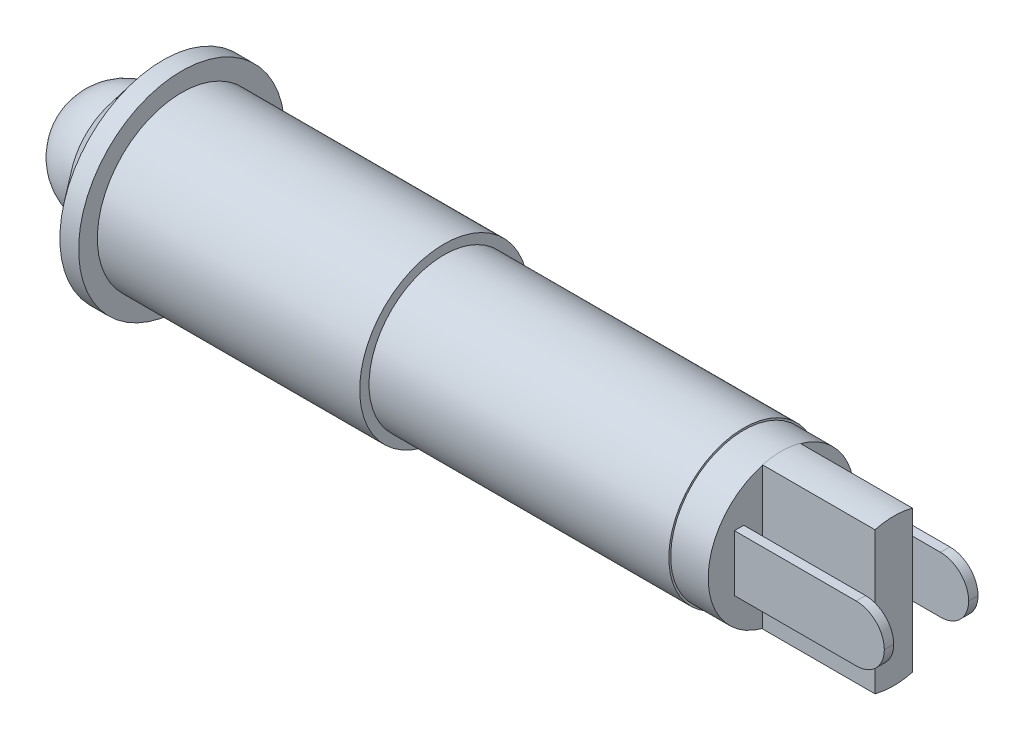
ISO-10303-21;
HEADER;
FILE_DESCRIPTION(('STEP AP214'),'2;1');
FILE_NAME('part.step','',(''),(''),'','','');
FILE_SCHEMA(('AUTOMOTIVE_DESIGN { 1 0 10303 214 1 1 1 1 }'));
ENDSEC;
DATA;
#1=APPLICATION_CONTEXT('core data for automotive mechanical design processes');
#2=APPLICATION_PROTOCOL_DEFINITION('international standard','automotive_design',2000,#1);
#3=PRODUCT_CONTEXT('',#1,'mechanical');
#4=PRODUCT('Part','Part','',(#3));
#5=PRODUCT_RELATED_PRODUCT_CATEGORY('part','',(#4));
#6=PRODUCT_DEFINITION_FORMATION('','',#4);
#7=PRODUCT_DEFINITION_CONTEXT('part definition',#1,'design');
#8=PRODUCT_DEFINITION('design','',#6,#7);
#9=PRODUCT_DEFINITION_SHAPE('','',#8);
#10=(LENGTH_UNIT() NAMED_UNIT(*) SI_UNIT(.MILLI.,.METRE.));
#11=(NAMED_UNIT(*) PLANE_ANGLE_UNIT() SI_UNIT($,.RADIAN.));
#12=(NAMED_UNIT(*) SI_UNIT($,.STERADIAN.) SOLID_ANGLE_UNIT());
#13=UNCERTAINTY_MEASURE_WITH_UNIT(LENGTH_MEASURE(1.E-05),#10,'distance_accuracy_value','');
#14=(GEOMETRIC_REPRESENTATION_CONTEXT(3) GLOBAL_UNCERTAINTY_ASSIGNED_CONTEXT((#13)) GLOBAL_UNIT_ASSIGNED_CONTEXT((#10,
#11,#12)) REPRESENTATION_CONTEXT('',''));
#15=CARTESIAN_POINT('',(0.,0.,0.));
#16=DIRECTION('',(0.,0.,1.));
#17=DIRECTION('',(1.,0.,0.));
#18=AXIS2_PLACEMENT_3D('',#15,#16,#17);
#19=CARTESIAN_POINT('',(35.,0.,0.));
#20=DIRECTION('',(1.,0.,0.));
#21=DIRECTION('',(0.,0.,-1.));
#22=AXIS2_PLACEMENT_3D('',#19,#20,#21);
#23=PLANE('',#22);
#24=DIRECTION('',(0.,1.,0.));
#25=VECTOR('',#24,1.);
#26=CARTESIAN_POINT('',(35.,3.79273138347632,-1.));
#27=LINE('',#26,#25);
#28=CARTESIAN_POINT('',(35.,-3.76961536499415,-1.));
#29=VERTEX_POINT('',#28);
#30=CARTESIAN_POINT('',(35.,3.76961536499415,-1.));
#31=VERTEX_POINT('',#30);
#32=EDGE_CURVE('E223',#29,#31,#27,.T.);
#33=ORIENTED_EDGE('',*,*,#32,.F.);
#34=CARTESIAN_POINT('',(35.,0.,0.));
#35=DIRECTION('',(1.,0.,0.));
#36=DIRECTION('',(0.,0.,-1.));
#37=AXIS2_PLACEMENT_3D('',#34,#35,#36);
#38=CIRCLE('',#37,3.9);
#39=EDGE_CURVE('E241',#29,#31,#38,.T.);
#40=ORIENTED_EDGE('',*,*,#39,.T.);
#41=EDGE_LOOP('',(#33,#40));
#42=FACE_BOUND('',#41,.T.);
#43=DIRECTION('',(0.,0.,-1.));
#44=VECTOR('',#43,1.);
#45=CARTESIAN_POINT('',(35.,-1.5,-2.));
#46=LINE('',#45,#44);
#47=CARTESIAN_POINT('',(35.,-1.5,-2.));
#48=VERTEX_POINT('',#47);
#49=CARTESIAN_POINT('',(35.,-1.5,-2.5));
#50=VERTEX_POINT('',#49);
#51=EDGE_CURVE('E151',#48,#50,#46,.T.);
#52=ORIENTED_EDGE('',*,*,#51,.F.);
#53=DIRECTION('',(0.,-1.,0.));
#54=VECTOR('',#53,1.);
#55=CARTESIAN_POINT('',(35.,1.5,-2.));
#56=LINE('',#55,#54);
#57=CARTESIAN_POINT('',(35.,1.5,-2.));
#58=VERTEX_POINT('',#57);
#59=EDGE_CURVE('E160',#58,#48,#56,.T.);
#60=ORIENTED_EDGE('',*,*,#59,.F.);
#61=DIRECTION('',(0.,0.,1.));
#62=VECTOR('',#61,1.);
#63=CARTESIAN_POINT('',(35.,1.5,-2.));
#64=LINE('',#63,#62);
#65=CARTESIAN_POINT('',(35.,1.5,-2.5));
#66=VERTEX_POINT('',#65);
#67=EDGE_CURVE('E172',#66,#58,#64,.T.);
#68=ORIENTED_EDGE('',*,*,#67,.F.);
#69=DIRECTION('',(0.,1.,0.));
#70=VECTOR('',#69,1.);
#71=CARTESIAN_POINT('',(35.,1.5,-2.5));
#72=LINE('',#71,#70);
#73=EDGE_CURVE('E170',#50,#66,#72,.T.);
#74=ORIENTED_EDGE('',*,*,#73,.F.);
#75=EDGE_LOOP('',(#52,#60,#68,#74));
#76=FACE_BOUND('',#75,.T.);
#77=ADVANCED_FACE('F34',(#42,#76),#23,.T.);
#78=DIRECTION('',(0.,-1.,0.));
#79=VECTOR('',#78,1.);
#80=CARTESIAN_POINT('',(35.,3.79273138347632,1.));
#81=LINE('',#80,#79);
#82=CARTESIAN_POINT('',(35.,3.76961536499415,1.));
#83=VERTEX_POINT('',#82);
#84=CARTESIAN_POINT('',(35.,-3.76961536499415,1.));
#85=VERTEX_POINT('',#84);
#86=EDGE_CURVE('E218',#83,#85,#81,.T.);
#87=ORIENTED_EDGE('',*,*,#86,.F.);
#88=EDGE_CURVE('E240',#83,#85,#38,.T.);
#89=ORIENTED_EDGE('',*,*,#88,.T.);
#90=EDGE_LOOP('',(#87,#89));
#91=FACE_BOUND('',#90,.T.);
#92=DIRECTION('',(0.,0.,-1.));
#93=VECTOR('',#92,1.);
#94=CARTESIAN_POINT('',(35.,-1.5,2.5));
#95=LINE('',#94,#93);
#96=CARTESIAN_POINT('',(35.,-1.5,2.5));
#97=VERTEX_POINT('',#96);
#98=CARTESIAN_POINT('',(35.,-1.5,2.));
#99=VERTEX_POINT('',#98);
#100=EDGE_CURVE('E182',#97,#99,#95,.T.);
#101=ORIENTED_EDGE('',*,*,#100,.F.);
#102=DIRECTION('',(0.,-1.,0.));
#103=VECTOR('',#102,1.);
#104=CARTESIAN_POINT('',(35.,1.5,2.5));
#105=LINE('',#104,#103);
#106=CARTESIAN_POINT('',(35.,1.5,2.5));
#107=VERTEX_POINT('',#106);
#108=EDGE_CURVE('E156',#107,#97,#105,.T.);
#109=ORIENTED_EDGE('',*,*,#108,.F.);
#110=DIRECTION('',(0.,0.,1.));
#111=VECTOR('',#110,1.);
#112=CARTESIAN_POINT('',(35.,1.5,2.5));
#113=LINE('',#112,#111);
#114=CARTESIAN_POINT('',(35.,1.5,2.));
#115=VERTEX_POINT('',#114);
#116=EDGE_CURVE('E188',#115,#107,#113,.T.);
#117=ORIENTED_EDGE('',*,*,#116,.F.);
#118=DIRECTION('',(0.,1.,0.));
#119=VECTOR('',#118,1.);
#120=CARTESIAN_POINT('',(35.,1.5,2.));
#121=LINE('',#120,#119);
#122=EDGE_CURVE('E185',#99,#115,#121,.T.);
#123=ORIENTED_EDGE('',*,*,#122,.F.);
#124=EDGE_LOOP('',(#101,#109,#117,#123));
#125=FACE_BOUND('',#124,.T.);
#126=ADVANCED_FACE('F307',(#91,#125),#23,.T.);
#127=CARTESIAN_POINT('',(33.,4.,0.));
#128=DIRECTION('',(1.,0.,0.));
#129=DIRECTION('',(0.,0.,-1.));
#130=AXIS2_PLACEMENT_3D('',#127,#128,#129);
#131=PLANE('',#130);
#132=CARTESIAN_POINT('',(33.,0.,0.));
#133=DIRECTION('',(1.,0.,0.));
#134=DIRECTION('',(0.,0.,-1.));
#135=AXIS2_PLACEMENT_3D('',#132,#133,#134);
#136=CIRCLE('',#135,4.);
#137=CARTESIAN_POINT('',(33.,0.,-4.));
#138=VERTEX_POINT('',#137);
#139=EDGE_CURVE('E246',#138,#138,#136,.T.);
#140=ORIENTED_EDGE('',*,*,#139,.T.);
#141=EDGE_LOOP('',(#140));
#142=FACE_BOUND('',#141,.T.);
#143=CARTESIAN_POINT('',(33.,0.,0.));
#144=DIRECTION('',(1.,0.,0.));
#145=DIRECTION('',(0.,0.,-1.));
#146=AXIS2_PLACEMENT_3D('',#143,#144,#145);
#147=CIRCLE('',#146,3.9);
#148=CARTESIAN_POINT('',(33.,0.,-3.9));
#149=VERTEX_POINT('',#148);
#150=EDGE_CURVE('E235',#149,#149,#147,.T.);
#151=ORIENTED_EDGE('',*,*,#150,.F.);
#152=EDGE_LOOP('',(#151));
#153=FACE_BOUND('',#152,.T.);
#154=ADVANCED_FACE('F326',(#142,#153),#131,.T.);
#155=CARTESIAN_POINT('',(2.,0.,0.));
#156=DIRECTION('',(1.,0.,0.));
#157=DIRECTION('',(0.,0.,-1.));
#158=AXIS2_PLACEMENT_3D('',#155,#156,#157);
#159=CONICAL_SURFACE('',#158,5.5,0.896055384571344);
#160=CARTESIAN_POINT('',(0.,0.,0.));
#161=DIRECTION('',(-1.,0.,0.));
#162=DIRECTION('',(0.,0.,1.));
#163=AXIS2_PLACEMENT_3D('',#160,#161,#162);
#164=CIRCLE('',#163,3.);
#165=CARTESIAN_POINT('',(0.,0.,3.));
#166=VERTEX_POINT('',#165);
#167=EDGE_CURVE('E239',#166,#166,#164,.T.);
#168=ORIENTED_EDGE('',*,*,#167,.F.);
#169=EDGE_LOOP('',(#168));
#170=FACE_BOUND('',#169,.T.);
#171=CARTESIAN_POINT('',(2.,0.,0.));
#172=DIRECTION('',(1.,0.,0.));
#173=DIRECTION('',(0.,0.,-1.));
#174=AXIS2_PLACEMENT_3D('',#171,#172,#173);
#175=CIRCLE('',#174,5.5);
#176=CARTESIAN_POINT('',(2.,0.,-5.5));
#177=VERTEX_POINT('',#176);
#178=EDGE_CURVE('E261',#177,#177,#175,.T.);
#179=ORIENTED_EDGE('',*,*,#178,.F.);
#180=EDGE_LOOP('',(#179));
#181=FACE_BOUND('',#180,.T.);
#182=ADVANCED_FACE('F344',(#170,#181),#159,.T.);
#183=CARTESIAN_POINT('',(33.,0.,0.));
#184=DIRECTION('',(1.,0.,0.));
#185=DIRECTION('',(0.,0.,-1.));
#186=AXIS2_PLACEMENT_3D('',#183,#184,#185);
#187=CYLINDRICAL_SURFACE('',#186,5.5);
#188=ORIENTED_EDGE('',*,*,#178,.T.);
#189=EDGE_LOOP('',(#188));
#190=FACE_BOUND('',#189,.T.);
#191=CARTESIAN_POINT('',(3.,0.,0.));
#192=DIRECTION('',(1.,0.,0.));
#193=DIRECTION('',(0.,0.,-1.));
#194=AXIS2_PLACEMENT_3D('',#191,#192,#193);
#195=CIRCLE('',#194,5.5);
#196=CARTESIAN_POINT('',(3.,0.,-5.5));
#197=VERTEX_POINT('',#196);
#198=EDGE_CURVE('E258',#197,#197,#195,.T.);
#199=ORIENTED_EDGE('',*,*,#198,.F.);
#200=EDGE_LOOP('',(#199));
#201=FACE_BOUND('',#200,.T.);
#202=ADVANCED_FACE('F360',(#190,#201),#187,.T.);
#203=CARTESIAN_POINT('',(3.,5.5,0.));
#204=DIRECTION('',(1.,0.,0.));
#205=DIRECTION('',(0.,0.,-1.));
#206=AXIS2_PLACEMENT_3D('',#203,#204,#205);
#207=PLANE('',#206);
#208=ORIENTED_EDGE('',*,*,#198,.T.);
#209=EDGE_LOOP('',(#208));
#210=FACE_BOUND('',#209,.T.);
#211=CARTESIAN_POINT('',(3.,0.,0.));
#212=DIRECTION('',(1.,0.,0.));
#213=DIRECTION('',(0.,0.,-1.));
#214=AXIS2_PLACEMENT_3D('',#211,#212,#213);
#215=CIRCLE('',#214,4.5);
#216=CARTESIAN_POINT('',(3.,0.,-4.5));
#217=VERTEX_POINT('',#216);
#218=EDGE_CURVE('E255',#217,#217,#215,.T.);
#219=ORIENTED_EDGE('',*,*,#218,.F.);
#220=EDGE_LOOP('',(#219));
#221=FACE_BOUND('',#220,.T.);
#222=ADVANCED_FACE('F356',(#210,#221),#207,.T.);
#223=CARTESIAN_POINT('',(33.,0.,0.));
#224=DIRECTION('',(1.,0.,0.));
#225=DIRECTION('',(0.,0.,-1.));
#226=AXIS2_PLACEMENT_3D('',#223,#224,#225);
#227=CYLINDRICAL_SURFACE('',#226,4.5);
#228=ORIENTED_EDGE('',*,*,#218,.T.);
#229=EDGE_LOOP('',(#228));
#230=FACE_BOUND('',#229,.T.);
#231=CARTESIAN_POINT('',(17.,0.,0.));
#232=DIRECTION('',(1.,0.,0.));
#233=DIRECTION('',(0.,0.,-1.));
#234=AXIS2_PLACEMENT_3D('',#231,#232,#233);
#235=CIRCLE('',#234,4.5);
#236=CARTESIAN_POINT('',(17.,0.,-4.5));
#237=VERTEX_POINT('',#236);
#238=EDGE_CURVE('E252',#237,#237,#235,.T.);
#239=ORIENTED_EDGE('',*,*,#238,.F.);
#240=EDGE_LOOP('',(#239));
#241=FACE_BOUND('',#240,.T.);
#242=ADVANCED_FACE('F352',(#230,#241),#227,.T.);
#243=CARTESIAN_POINT('',(17.,4.5,0.));
#244=DIRECTION('',(1.,0.,0.));
#245=DIRECTION('',(0.,0.,-1.));
#246=AXIS2_PLACEMENT_3D('',#243,#244,#245);
#247=PLANE('',#246);
#248=ORIENTED_EDGE('',*,*,#238,.T.);
#249=EDGE_LOOP('',(#248));
#250=FACE_BOUND('',#249,.T.);
#251=CARTESIAN_POINT('',(17.,0.,0.));
#252=DIRECTION('',(1.,0.,0.));
#253=DIRECTION('',(0.,0.,-1.));
#254=AXIS2_PLACEMENT_3D('',#251,#252,#253);
#255=CIRCLE('',#254,4.);
#256=CARTESIAN_POINT('',(17.,0.,-4.));
#257=VERTEX_POINT('',#256);
#258=EDGE_CURVE('E249',#257,#257,#255,.T.);
#259=ORIENTED_EDGE('',*,*,#258,.F.);
#260=EDGE_LOOP('',(#259));
#261=FACE_BOUND('',#260,.T.);
#262=ADVANCED_FACE('F348',(#250,#261),#247,.T.);
#263=CARTESIAN_POINT('',(33.,0.,0.));
#264=DIRECTION('',(1.,0.,0.));
#265=DIRECTION('',(0.,0.,-1.));
#266=AXIS2_PLACEMENT_3D('',#263,#264,#265);
#267=CYLINDRICAL_SURFACE('',#266,4.);
#268=ORIENTED_EDGE('',*,*,#258,.T.);
#269=EDGE_LOOP('',(#268));
#270=FACE_BOUND('',#269,.T.);
#271=ORIENTED_EDGE('',*,*,#139,.F.);
#272=EDGE_LOOP('',(#271));
#273=FACE_BOUND('',#272,.T.);
#274=ADVANCED_FACE('F340',(#270,#273),#267,.T.);
#275=CARTESIAN_POINT('',(0.,0.,0.));
#276=DIRECTION('',(0.,1.,0.));
#277=DIRECTION('',(1.,0.,0.));
#278=AXIS2_PLACEMENT_3D('',#275,#276,#277);
#279=SPHERICAL_SURFACE('',#278,3.);
#280=CARTESIAN_POINT('',(0.,0.,0.));
#281=DIRECTION('',(-1.,0.,0.));
#282=DIRECTION('',(0.,0.,1.));
#283=AXIS2_PLACEMENT_3D('',#280,#281,#282);
#284=SPHERICAL_SURFACE('',#283,3.);
#285=ORIENTED_EDGE('',*,*,#167,.T.);
#286=EDGE_LOOP('',(#285));
#287=FACE_BOUND('',#286,.T.);
#288=ADVANCED_FACE('F336',(#287),#284,.T.);
#289=CARTESIAN_POINT('',(35.,0.,0.));
#290=DIRECTION('',(-1.,0.,0.));
#291=DIRECTION('',(0.,0.,1.));
#292=AXIS2_PLACEMENT_3D('',#289,#290,#291);
#293=CYLINDRICAL_SURFACE('',#292,3.9);
#294=EDGE_CURVE('E236',#31,#83,#38,.T.);
#295=ORIENTED_EDGE('',*,*,#294,.F.);
#296=ORIENTED_EDGE('',*,*,#39,.F.);
#297=EDGE_CURVE('E615',#85,#29,#38,.T.);
#298=ORIENTED_EDGE('',*,*,#297,.F.);
#299=ORIENTED_EDGE('',*,*,#88,.F.);
#300=EDGE_LOOP('',(#295,#296,#298,#299));
#301=FACE_BOUND('',#300,.T.);
#302=ORIENTED_EDGE('',*,*,#150,.T.);
#303=EDGE_LOOP('',(#302));
#304=FACE_BOUND('',#303,.T.);
#305=ADVANCED_FACE('F332',(#301,#304),#293,.T.);
#306=CARTESIAN_POINT('',(35.,0.,0.));
#307=DIRECTION('',(1.,0.,0.));
#308=DIRECTION('',(0.,0.,-1.));
#309=AXIS2_PLACEMENT_3D('',#306,#307,#308);
#310=PLANE('',#309);
#311=CARTESIAN_POINT('',(35.,3.79273138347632,-1.));
#312=VERTEX_POINT('',#311);
#313=EDGE_CURVE('E220',#31,#312,#27,.T.);
#314=ORIENTED_EDGE('',*,*,#313,.F.);
#315=ORIENTED_EDGE('',*,*,#294,.T.);
#316=CARTESIAN_POINT('',(35.,3.79273138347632,1.));
#317=VERTEX_POINT('',#316);
#318=EDGE_CURVE('E214',#317,#83,#81,.T.);
#319=ORIENTED_EDGE('',*,*,#318,.F.);
#320=CARTESIAN_POINT('',(35.,0.,0.));
#321=DIRECTION('',(1.,0.,0.));
#322=DIRECTION('',(0.,0.,-1.));
#323=AXIS2_PLACEMENT_3D('',#320,#321,#322);
#324=CIRCLE('',#323,3.92234768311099);
#325=EDGE_CURVE('E199',#312,#317,#324,.T.);
#326=ORIENTED_EDGE('',*,*,#325,.F.);
#327=EDGE_LOOP('',(#314,#315,#319,#326));
#328=FACE_BOUND('',#327,.T.);
#329=ADVANCED_FACE('F335',(#328),#310,.F.);
#330=CARTESIAN_POINT('',(35.,-3.79273138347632,1.));
#331=VERTEX_POINT('',#330);
#332=EDGE_CURVE('E213',#85,#331,#81,.T.);
#333=ORIENTED_EDGE('',*,*,#332,.F.);
#334=ORIENTED_EDGE('',*,*,#297,.T.);
#335=CARTESIAN_POINT('',(35.,-3.79273138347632,-1.));
#336=VERTEX_POINT('',#335);
#337=EDGE_CURVE('E204',#336,#29,#27,.T.);
#338=ORIENTED_EDGE('',*,*,#337,.F.);
#339=CARTESIAN_POINT('',(35.,0.,0.));
#340=DIRECTION('',(1.,0.,0.));
#341=DIRECTION('',(0.,0.,-1.));
#342=AXIS2_PLACEMENT_3D('',#339,#340,#341);
#343=CIRCLE('',#342,3.92234768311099);
#344=EDGE_CURVE('E217',#331,#336,#343,.T.);
#345=ORIENTED_EDGE('',*,*,#344,.F.);
#346=EDGE_LOOP('',(#333,#334,#338,#345));
#347=FACE_BOUND('',#346,.T.);
#348=ADVANCED_FACE('F493',(#347),#310,.F.);
#349=CARTESIAN_POINT('',(41.,0.,0.));
#350=DIRECTION('',(-1.,0.,0.));
#351=DIRECTION('',(0.,0.,1.));
#352=AXIS2_PLACEMENT_3D('',#349,#350,#351);
#353=CYLINDRICAL_SURFACE('',#352,3.92234768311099);
#354=ORIENTED_EDGE('',*,*,#325,.T.);
#355=DIRECTION('',(-1.,0.,0.));
#356=VECTOR('',#355,1.);
#357=CARTESIAN_POINT('',(41.,3.79273138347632,1.));
#358=LINE('',#357,#356);
#359=CARTESIAN_POINT('',(41.,3.79273138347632,1.));
#360=VERTEX_POINT('',#359);
#361=EDGE_CURVE('E232',#360,#317,#358,.T.);
#362=ORIENTED_EDGE('',*,*,#361,.F.);
#363=CARTESIAN_POINT('',(41.,0.,0.));
#364=DIRECTION('',(1.,0.,0.));
#365=DIRECTION('',(0.,0.,-1.));
#366=AXIS2_PLACEMENT_3D('',#363,#364,#365);
#367=CIRCLE('',#366,3.92234768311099);
#368=CARTESIAN_POINT('',(41.,3.79273138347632,-1.));
#369=VERTEX_POINT('',#368);
#370=EDGE_CURVE('E200',#369,#360,#367,.T.);
#371=ORIENTED_EDGE('',*,*,#370,.F.);
#372=DIRECTION('',(-1.,0.,0.));
#373=VECTOR('',#372,1.);
#374=CARTESIAN_POINT('',(41.,3.79273138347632,-1.));
#375=LINE('',#374,#373);
#376=EDGE_CURVE('E210',#369,#312,#375,.T.);
#377=ORIENTED_EDGE('',*,*,#376,.T.);
#378=EDGE_LOOP('',(#354,#362,#371,#377));
#379=FACE_BOUND('',#378,.T.);
#380=ADVANCED_FACE('F330',(#379),#353,.T.);
#381=CARTESIAN_POINT('',(41.,3.79273138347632,1.));
#382=DIRECTION('',(0.,0.,-1.));
#383=DIRECTION('',(-1.,0.,0.));
#384=AXIS2_PLACEMENT_3D('',#381,#382,#383);
#385=PLANE('',#384);
#386=ORIENTED_EDGE('',*,*,#318,.T.);
#387=ORIENTED_EDGE('',*,*,#86,.T.);
#388=ORIENTED_EDGE('',*,*,#332,.T.);
#389=DIRECTION('',(-1.,0.,0.));
#390=VECTOR('',#389,1.);
#391=CARTESIAN_POINT('',(41.,-3.79273138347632,1.));
#392=LINE('',#391,#390);
#393=CARTESIAN_POINT('',(41.,-3.79273138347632,1.));
#394=VERTEX_POINT('',#393);
#395=EDGE_CURVE('E229',#394,#331,#392,.T.);
#396=ORIENTED_EDGE('',*,*,#395,.F.);
#397=DIRECTION('',(0.,-1.,0.));
#398=VECTOR('',#397,1.);
#399=CARTESIAN_POINT('',(41.,3.79273138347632,1.));
#400=LINE('',#399,#398);
#401=EDGE_CURVE('E203',#360,#394,#400,.T.);
#402=ORIENTED_EDGE('',*,*,#401,.F.);
#403=ORIENTED_EDGE('',*,*,#361,.T.);
#404=EDGE_LOOP('',(#386,#387,#388,#396,#402,#403));
#405=FACE_BOUND('',#404,.T.);
#406=ADVANCED_FACE('F475',(#405),#385,.F.);
#407=CARTESIAN_POINT('',(41.,0.,0.));
#408=DIRECTION('',(-1.,0.,0.));
#409=DIRECTION('',(0.,0.,1.));
#410=AXIS2_PLACEMENT_3D('',#407,#408,#409);
#411=CYLINDRICAL_SURFACE('',#410,3.92234768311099);
#412=ORIENTED_EDGE('',*,*,#344,.T.);
#413=DIRECTION('',(-1.,0.,0.));
#414=VECTOR('',#413,1.);
#415=CARTESIAN_POINT('',(41.,-3.79273138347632,-1.));
#416=LINE('',#415,#414);
#417=CARTESIAN_POINT('',(41.,-3.79273138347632,-1.));
#418=VERTEX_POINT('',#417);
#419=EDGE_CURVE('E226',#418,#336,#416,.T.);
#420=ORIENTED_EDGE('',*,*,#419,.F.);
#421=CARTESIAN_POINT('',(41.,0.,0.));
#422=DIRECTION('',(1.,0.,0.));
#423=DIRECTION('',(0.,0.,-1.));
#424=AXIS2_PLACEMENT_3D('',#421,#422,#423);
#425=CIRCLE('',#424,3.92234768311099);
#426=EDGE_CURVE('E206',#394,#418,#425,.T.);
#427=ORIENTED_EDGE('',*,*,#426,.F.);
#428=ORIENTED_EDGE('',*,*,#395,.T.);
#429=EDGE_LOOP('',(#412,#420,#427,#428));
#430=FACE_BOUND('',#429,.T.);
#431=ADVANCED_FACE('F465',(#430),#411,.T.);
#432=CARTESIAN_POINT('',(41.,3.79273138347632,-1.));
#433=DIRECTION('',(0.,0.,1.));
#434=DIRECTION('',(1.,0.,0.));
#435=AXIS2_PLACEMENT_3D('',#432,#433,#434);
#436=PLANE('',#435);
#437=ORIENTED_EDGE('',*,*,#337,.T.);
#438=ORIENTED_EDGE('',*,*,#32,.T.);
#439=ORIENTED_EDGE('',*,*,#313,.T.);
#440=ORIENTED_EDGE('',*,*,#376,.F.);
#441=DIRECTION('',(0.,1.,0.));
#442=VECTOR('',#441,1.);
#443=CARTESIAN_POINT('',(41.,3.79273138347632,-1.));
#444=LINE('',#443,#442);
#445=EDGE_CURVE('E208',#418,#369,#444,.T.);
#446=ORIENTED_EDGE('',*,*,#445,.F.);
#447=ORIENTED_EDGE('',*,*,#419,.T.);
#448=EDGE_LOOP('',(#437,#438,#439,#440,#446,#447));
#449=FACE_BOUND('',#448,.T.);
#450=ADVANCED_FACE('F455',(#449),#436,.F.);
#451=CARTESIAN_POINT('',(41.,0.,0.));
#452=DIRECTION('',(1.,0.,0.));
#453=DIRECTION('',(0.,0.,-1.));
#454=AXIS2_PLACEMENT_3D('',#451,#452,#453);
#455=PLANE('',#454);
#456=ORIENTED_EDGE('',*,*,#370,.T.);
#457=ORIENTED_EDGE('',*,*,#401,.T.);
#458=ORIENTED_EDGE('',*,*,#426,.T.);
#459=ORIENTED_EDGE('',*,*,#445,.T.);
#460=EDGE_LOOP('',(#456,#457,#458,#459));
#461=FACE_BOUND('',#460,.T.);
#462=ADVANCED_FACE('F318',(#461),#455,.T.);
#463=CARTESIAN_POINT('',(43.,1.5,2.5));
#464=DIRECTION('',(0.,0.,-1.));
#465=DIRECTION('',(-1.,0.,0.));
#466=AXIS2_PLACEMENT_3D('',#463,#464,#465);
#467=PLANE('',#466);
#468=DIRECTION('',(-1.,0.,0.));
#469=VECTOR('',#468,1.);
#470=CARTESIAN_POINT('',(43.,-1.5,2.5));
#471=LINE('',#470,#469);
#472=CARTESIAN_POINT('',(41.5,-1.5,2.5));
#473=VERTEX_POINT('',#472);
#474=EDGE_CURVE('E197',#473,#97,#471,.T.);
#475=ORIENTED_EDGE('',*,*,#474,.F.);
#476=CARTESIAN_POINT('',(41.5,0.,2.5));
#477=DIRECTION('',(0.,0.,-1.));
#478=DIRECTION('',(-1.,0.,0.));
#479=AXIS2_PLACEMENT_3D('',#476,#477,#478);
#480=CIRCLE('',#479,1.5);
#481=CARTESIAN_POINT('',(43.,0.,2.5));
#482=VERTEX_POINT('',#481);
#483=EDGE_CURVE('E43',#473,#482,#480,.F.);
#484=ORIENTED_EDGE('',*,*,#483,.T.);
#485=CARTESIAN_POINT('',(41.5,0.,2.5));
#486=DIRECTION('',(0.,0.,-1.));
#487=DIRECTION('',(-1.,0.,0.));
#488=AXIS2_PLACEMENT_3D('',#485,#486,#487);
#489=CIRCLE('',#488,1.5);
#490=CARTESIAN_POINT('',(41.5,1.5,2.5));
#491=VERTEX_POINT('',#490);
#492=EDGE_CURVE('E51',#482,#491,#489,.F.);
#493=ORIENTED_EDGE('',*,*,#492,.T.);
#494=DIRECTION('',(-1.,0.,0.));
#495=VECTOR('',#494,1.);
#496=CARTESIAN_POINT('',(43.,1.5,2.5));
#497=LINE('',#496,#495);
#498=EDGE_CURVE('E191',#491,#107,#497,.T.);
#499=ORIENTED_EDGE('',*,*,#498,.T.);
#500=ORIENTED_EDGE('',*,*,#108,.T.);
#501=EDGE_LOOP('',(#475,#484,#493,#499,#500));
#502=FACE_BOUND('',#501,.T.);
#503=ADVANCED_FACE('F308',(#502),#467,.F.);
#504=CARTESIAN_POINT('',(43.,-1.5,2.5));
#505=DIRECTION('',(0.,1.,0.));
#506=DIRECTION('',(0.,0.,1.));
#507=AXIS2_PLACEMENT_3D('',#504,#505,#506);
#508=PLANE('',#507);
#509=DIRECTION('',(-1.,0.,0.));
#510=VECTOR('',#509,1.);
#511=CARTESIAN_POINT('',(43.,-1.5,2.));
#512=LINE('',#511,#510);
#513=CARTESIAN_POINT('',(41.5,-1.5,2.));
#514=VERTEX_POINT('',#513);
#515=EDGE_CURVE('E195',#514,#99,#512,.T.);
#516=ORIENTED_EDGE('',*,*,#515,.F.);
#517=DIRECTION('',(0.,0.,-1.));
#518=VECTOR('',#517,1.);
#519=CARTESIAN_POINT('',(41.5,-1.5,2.5));
#520=LINE('',#519,#518);
#521=EDGE_CURVE('E279',#514,#473,#520,.F.);
#522=ORIENTED_EDGE('',*,*,#521,.T.);
#523=ORIENTED_EDGE('',*,*,#474,.T.);
#524=ORIENTED_EDGE('',*,*,#100,.T.);
#525=EDGE_LOOP('',(#516,#522,#523,#524));
#526=FACE_BOUND('',#525,.T.);
#527=ADVANCED_FACE('F310',(#526),#508,.F.);
#528=CARTESIAN_POINT('',(43.,1.5,2.));
#529=DIRECTION('',(0.,0.,1.));
#530=DIRECTION('',(1.,0.,0.));
#531=AXIS2_PLACEMENT_3D('',#528,#529,#530);
#532=PLANE('',#531);
#533=CARTESIAN_POINT('',(41.5,0.,2.));
#534=DIRECTION('',(0.,0.,1.));
#535=DIRECTION('',(1.,0.,0.));
#536=AXIS2_PLACEMENT_3D('',#533,#534,#535);
#537=CIRCLE('',#536,1.5);
#538=CARTESIAN_POINT('',(41.5,1.5,2.));
#539=VERTEX_POINT('',#538);
#540=CARTESIAN_POINT('',(43.,0.,2.));
#541=VERTEX_POINT('',#540);
#542=EDGE_CURVE('E275',#539,#541,#537,.F.);
#543=ORIENTED_EDGE('',*,*,#542,.T.);
#544=CARTESIAN_POINT('',(41.5,0.,2.));
#545=DIRECTION('',(0.,0.,1.));
#546=DIRECTION('',(1.,0.,0.));
#547=AXIS2_PLACEMENT_3D('',#544,#545,#546);
#548=CIRCLE('',#547,1.5);
#549=EDGE_CURVE('E277',#541,#514,#548,.F.);
#550=ORIENTED_EDGE('',*,*,#549,.T.);
#551=ORIENTED_EDGE('',*,*,#515,.T.);
#552=ORIENTED_EDGE('',*,*,#122,.T.);
#553=DIRECTION('',(-1.,0.,0.));
#554=VECTOR('',#553,1.);
#555=CARTESIAN_POINT('',(43.,1.5,2.));
#556=LINE('',#555,#554);
#557=EDGE_CURVE('E193',#539,#115,#556,.T.);
#558=ORIENTED_EDGE('',*,*,#557,.F.);
#559=EDGE_LOOP('',(#543,#550,#551,#552,#558));
#560=FACE_BOUND('',#559,.T.);
#561=ADVANCED_FACE('F300',(#560),#532,.F.);
#562=CARTESIAN_POINT('',(43.,1.5,2.5));
#563=DIRECTION('',(0.,-1.,0.));
#564=DIRECTION('',(0.,0.,-1.));
#565=AXIS2_PLACEMENT_3D('',#562,#563,#564);
#566=PLANE('',#565);
#567=ORIENTED_EDGE('',*,*,#498,.F.);
#568=DIRECTION('',(0.,0.,1.));
#569=VECTOR('',#568,1.);
#570=CARTESIAN_POINT('',(41.5,1.5,2.));
#571=LINE('',#570,#569);
#572=EDGE_CURVE('E11',#491,#539,#571,.F.);
#573=ORIENTED_EDGE('',*,*,#572,.T.);
#574=ORIENTED_EDGE('',*,*,#557,.T.);
#575=ORIENTED_EDGE('',*,*,#116,.T.);
#576=EDGE_LOOP('',(#567,#573,#574,#575));
#577=FACE_BOUND('',#576,.T.);
#578=ADVANCED_FACE('F298',(#577),#566,.F.);
#579=CARTESIAN_POINT('',(43.,1.5,-2.));
#580=DIRECTION('',(0.,0.,-1.));
#581=DIRECTION('',(0.,1.,0.));
#582=AXIS2_PLACEMENT_3D('',#579,#580,#581);
#583=PLANE('',#582);
#584=DIRECTION('',(-1.,0.,0.));
#585=VECTOR('',#584,1.);
#586=CARTESIAN_POINT('',(43.,-1.5,-2.));
#587=LINE('',#586,#585);
#588=CARTESIAN_POINT('',(41.5,-1.5,-2.));
#589=VERTEX_POINT('',#588);
#590=EDGE_CURVE('E146',#589,#48,#587,.T.);
#591=ORIENTED_EDGE('',*,*,#590,.F.);
#592=CARTESIAN_POINT('',(41.5,0.,-2.));
#593=DIRECTION('',(0.,0.,-1.));
#594=DIRECTION('',(0.,1.,0.));
#595=AXIS2_PLACEMENT_3D('',#592,#593,#594);
#596=CIRCLE('',#595,1.5);
#597=CARTESIAN_POINT('',(43.,0.,-2.));
#598=VERTEX_POINT('',#597);
#599=EDGE_CURVE('E271',#589,#598,#596,.F.);
#600=ORIENTED_EDGE('',*,*,#599,.T.);
#601=CARTESIAN_POINT('',(41.5,0.,-2.));
#602=DIRECTION('',(0.,0.,-1.));
#603=DIRECTION('',(0.,1.,0.));
#604=AXIS2_PLACEMENT_3D('',#601,#602,#603);
#605=CIRCLE('',#604,1.5);
#606=CARTESIAN_POINT('',(41.5,1.5,-2.));
#607=VERTEX_POINT('',#606);
#608=EDGE_CURVE('E269',#598,#607,#605,.F.);
#609=ORIENTED_EDGE('',*,*,#608,.T.);
#610=DIRECTION('',(-1.,0.,0.));
#611=VECTOR('',#610,1.);
#612=CARTESIAN_POINT('',(43.,1.5,-2.));
#613=LINE('',#612,#611);
#614=EDGE_CURVE('E163',#607,#58,#613,.T.);
#615=ORIENTED_EDGE('',*,*,#614,.T.);
#616=ORIENTED_EDGE('',*,*,#59,.T.);
#617=EDGE_LOOP('',(#591,#600,#609,#615,#616));
#618=FACE_BOUND('',#617,.T.);
#619=ADVANCED_FACE('F161',(#618),#583,.F.);
#620=CARTESIAN_POINT('',(43.,-1.5,-2.));
#621=DIRECTION('',(0.,1.,0.));
#622=DIRECTION('',(0.,0.,1.));
#623=AXIS2_PLACEMENT_3D('',#620,#621,#622);
#624=PLANE('',#623);
#625=DIRECTION('',(-1.,0.,0.));
#626=VECTOR('',#625,1.);
#627=CARTESIAN_POINT('',(43.,-1.5,-2.5));
#628=LINE('',#627,#626);
#629=CARTESIAN_POINT('',(41.5,-1.5,-2.5));
#630=VERTEX_POINT('',#629);
#631=EDGE_CURVE('E157',#630,#50,#628,.T.);
#632=ORIENTED_EDGE('',*,*,#631,.F.);
#633=DIRECTION('',(0.,0.,-1.));
#634=VECTOR('',#633,1.);
#635=CARTESIAN_POINT('',(41.5,-1.5,-2.));
#636=LINE('',#635,#634);
#637=EDGE_CURVE('E154',#630,#589,#636,.F.);
#638=ORIENTED_EDGE('',*,*,#637,.T.);
#639=ORIENTED_EDGE('',*,*,#590,.T.);
#640=ORIENTED_EDGE('',*,*,#51,.T.);
#641=EDGE_LOOP('',(#632,#638,#639,#640));
#642=FACE_BOUND('',#641,.T.);
#643=ADVANCED_FACE('F149',(#642),#624,.F.);
#644=CARTESIAN_POINT('',(43.,1.5,-2.5));
#645=DIRECTION('',(0.,0.,1.));
#646=DIRECTION('',(1.,0.,0.));
#647=AXIS2_PLACEMENT_3D('',#644,#645,#646);
#648=PLANE('',#647);
#649=CARTESIAN_POINT('',(41.5,0.,-2.5));
#650=DIRECTION('',(0.,0.,1.));
#651=DIRECTION('',(1.,0.,0.));
#652=AXIS2_PLACEMENT_3D('',#649,#650,#651);
#653=CIRCLE('',#652,1.5);
#654=CARTESIAN_POINT('',(41.5,1.5,-2.5));
#655=VERTEX_POINT('',#654);
#656=CARTESIAN_POINT('',(43.,0.,-2.5));
#657=VERTEX_POINT('',#656);
#658=EDGE_CURVE('E264',#655,#657,#653,.F.);
#659=ORIENTED_EDGE('',*,*,#658,.T.);
#660=CARTESIAN_POINT('',(41.5,0.,-2.5));
#661=DIRECTION('',(0.,0.,1.));
#662=DIRECTION('',(1.,0.,0.));
#663=AXIS2_PLACEMENT_3D('',#660,#661,#662);
#664=CIRCLE('',#663,1.5);
#665=EDGE_CURVE('E266',#657,#630,#664,.F.);
#666=ORIENTED_EDGE('',*,*,#665,.T.);
#667=ORIENTED_EDGE('',*,*,#631,.T.);
#668=ORIENTED_EDGE('',*,*,#73,.T.);
#669=DIRECTION('',(-1.,0.,0.));
#670=VECTOR('',#669,1.);
#671=CARTESIAN_POINT('',(43.,1.5,-2.5));
#672=LINE('',#671,#670);
#673=EDGE_CURVE('E177',#655,#66,#672,.T.);
#674=ORIENTED_EDGE('',*,*,#673,.F.);
#675=EDGE_LOOP('',(#659,#666,#667,#668,#674));
#676=FACE_BOUND('',#675,.T.);
#677=ADVANCED_FACE('F395',(#676),#648,.F.);
#678=CARTESIAN_POINT('',(43.,1.5,-2.));
#679=DIRECTION('',(0.,-1.,0.));
#680=DIRECTION('',(0.,0.,-1.));
#681=AXIS2_PLACEMENT_3D('',#678,#679,#680);
#682=PLANE('',#681);
#683=ORIENTED_EDGE('',*,*,#614,.F.);
#684=DIRECTION('',(0.,0.,1.));
#685=VECTOR('',#684,1.);
#686=CARTESIAN_POINT('',(41.5,1.5,-2.5));
#687=LINE('',#686,#685);
#688=EDGE_CURVE('E273',#607,#655,#687,.F.);
#689=ORIENTED_EDGE('',*,*,#688,.T.);
#690=ORIENTED_EDGE('',*,*,#673,.T.);
#691=ORIENTED_EDGE('',*,*,#67,.T.);
#692=EDGE_LOOP('',(#683,#689,#690,#691));
#693=FACE_BOUND('',#692,.T.);
#694=ADVANCED_FACE('F373',(#693),#682,.F.);
#695=CARTESIAN_POINT('',(41.5,0.,0.));
#696=DIRECTION('',(0.,0.,-1.));
#697=DIRECTION('',(-1.,0.,0.));
#698=AXIS2_PLACEMENT_3D('',#695,#696,#697);
#699=CYLINDRICAL_SURFACE('',#698,1.5);
#700=ORIENTED_EDGE('',*,*,#688,.F.);
#701=ORIENTED_EDGE('',*,*,#608,.F.);
#702=DIRECTION('',(0.,0.,1.));
#703=VECTOR('',#702,1.);
#704=CARTESIAN_POINT('',(43.,0.,-2.));
#705=LINE('',#704,#703);
#706=EDGE_CURVE('E167',#657,#598,#705,.T.);
#707=ORIENTED_EDGE('',*,*,#706,.F.);
#708=ORIENTED_EDGE('',*,*,#658,.F.);
#709=EDGE_LOOP('',(#700,#701,#707,#708));
#710=FACE_BOUND('',#709,.T.);
#711=ADVANCED_FACE('F371',(#710),#699,.T.);
#712=CARTESIAN_POINT('',(41.5,0.,0.));
#713=DIRECTION('',(0.,0.,1.));
#714=DIRECTION('',(1.,0.,0.));
#715=AXIS2_PLACEMENT_3D('',#712,#713,#714);
#716=CYLINDRICAL_SURFACE('',#715,1.5);
#717=ORIENTED_EDGE('',*,*,#599,.F.);
#718=ORIENTED_EDGE('',*,*,#637,.F.);
#719=ORIENTED_EDGE('',*,*,#665,.F.);
#720=ORIENTED_EDGE('',*,*,#706,.T.);
#721=EDGE_LOOP('',(#717,#718,#719,#720));
#722=FACE_BOUND('',#721,.T.);
#723=ADVANCED_FACE('F368',(#722),#716,.T.);
#724=CARTESIAN_POINT('',(41.5,0.,0.));
#725=DIRECTION('',(0.,0.,-1.));
#726=DIRECTION('',(-1.,0.,0.));
#727=AXIS2_PLACEMENT_3D('',#724,#725,#726);
#728=CYLINDRICAL_SURFACE('',#727,1.5);
#729=ORIENTED_EDGE('',*,*,#572,.F.);
#730=ORIENTED_EDGE('',*,*,#492,.F.);
#731=DIRECTION('',(0.,0.,1.));
#732=VECTOR('',#731,1.);
#733=CARTESIAN_POINT('',(43.,0.,2.5));
#734=LINE('',#733,#732);
#735=EDGE_CURVE('E38',#541,#482,#734,.T.);
#736=ORIENTED_EDGE('',*,*,#735,.F.);
#737=ORIENTED_EDGE('',*,*,#542,.F.);
#738=EDGE_LOOP('',(#729,#730,#736,#737));
#739=FACE_BOUND('',#738,.T.);
#740=ADVANCED_FACE('F36',(#739),#728,.T.);
#741=CARTESIAN_POINT('',(41.5,0.,0.));
#742=DIRECTION('',(0.,0.,1.));
#743=DIRECTION('',(1.,0.,0.));
#744=AXIS2_PLACEMENT_3D('',#741,#742,#743);
#745=CYLINDRICAL_SURFACE('',#744,1.5);
#746=ORIENTED_EDGE('',*,*,#483,.F.);
#747=ORIENTED_EDGE('',*,*,#521,.F.);
#748=ORIENTED_EDGE('',*,*,#549,.F.);
#749=ORIENTED_EDGE('',*,*,#735,.T.);
#750=EDGE_LOOP('',(#746,#747,#748,#749));
#751=FACE_BOUND('',#750,.T.);
#752=ADVANCED_FACE('F291',(#751),#745,.T.);
#753=CLOSED_SHELL('',(#77,#126,#154,#182,#202,#222,#242,#262,#274,#288,#305,#329,#348,#380,#406,
#431,#450,#462,#503,#527,#561,#578,#619,#643,#677,#694,#711,#723,#740,#752));
#754=MANIFOLD_SOLID_BREP('B2',#753);
#755=ADVANCED_BREP_SHAPE_REPRESENTATION('',(#18,#754),#14);
#756=SHAPE_DEFINITION_REPRESENTATION(#9,#755);
ENDSEC;
END-ISO-10303-21;
